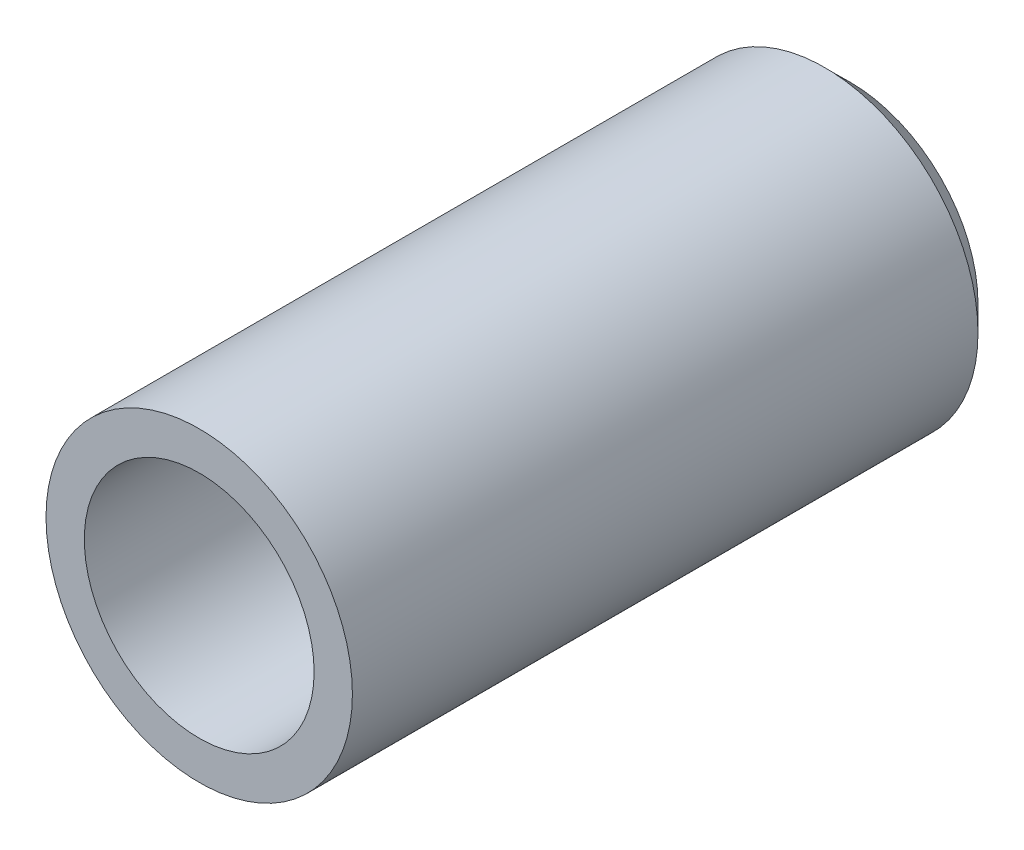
from build123d import *

# Parameters (mm, degrees)
ESQUISSE1_R             = 6
BASE_EXTRUSION_DEPTH    = 25.5
ESQUISSE2_R             = 4.5
ENL_V_MAT_EXTRU_1_DEPTH = 22.5
ESQUISSE3_R             = 3.02
ENL_V_MAT_EXTRU_2_DEPTH = 27.874709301
CHANFREIN1_SIZE         = 0.5
CONG_1_R                = 0.5
CHANFREIN2_SIZE         = 1


with BuildPart() as part:
    # Esquisse1 → Base-Extrusion (new body)
    with BuildSketch(Plane.XY):
        Circle(ESQUISSE1_R)
    extrude(amount=BASE_EXTRUSION_DEPTH)

    # Esquisse2 → Enl_v. mat.-Extru.1 (cut)
    with BuildSketch(Plane.XY.offset(25.5)):
        Circle(ESQUISSE2_R)
    extrude(amount=-ENL_V_MAT_EXTRU_1_DEPTH, mode=Mode.SUBTRACT)

    # Esquisse3 → Enl_v. mat.-Extru.2 (cut, through all)
    with BuildSketch(Plane(origin=(0, 0, 0), x_dir=(-1, 0, 0), z_dir=(0, 0, -1))):
        Circle(ESQUISSE3_R)
    extrude(amount=-ENL_V_MAT_EXTRU_2_DEPTH, mode=Mode.SUBTRACT)

    # Chanfrein1
    chanfrein1_edges = [part.edges().sort_by_distance(p)[0] for p in [
        (3.02, 0, 3),
    ]]
    chamfer(chanfrein1_edges, length=CHANFREIN1_SIZE)

    # Cong_1
    cong_1_edges = [part.edges().sort_by_distance(p)[0] for p in [
        (-4.5, 0, 3),
    ]]
    fillet(cong_1_edges, radius=CONG_1_R)

    # Chanfrein2
    chanfrein2_edges = [part.edges().sort_by_distance(p)[0] for p in [
        (-6, 0, 0),
    ]]
    chamfer(chanfrein2_edges, length=CHANFREIN2_SIZE)


solid = part.part
